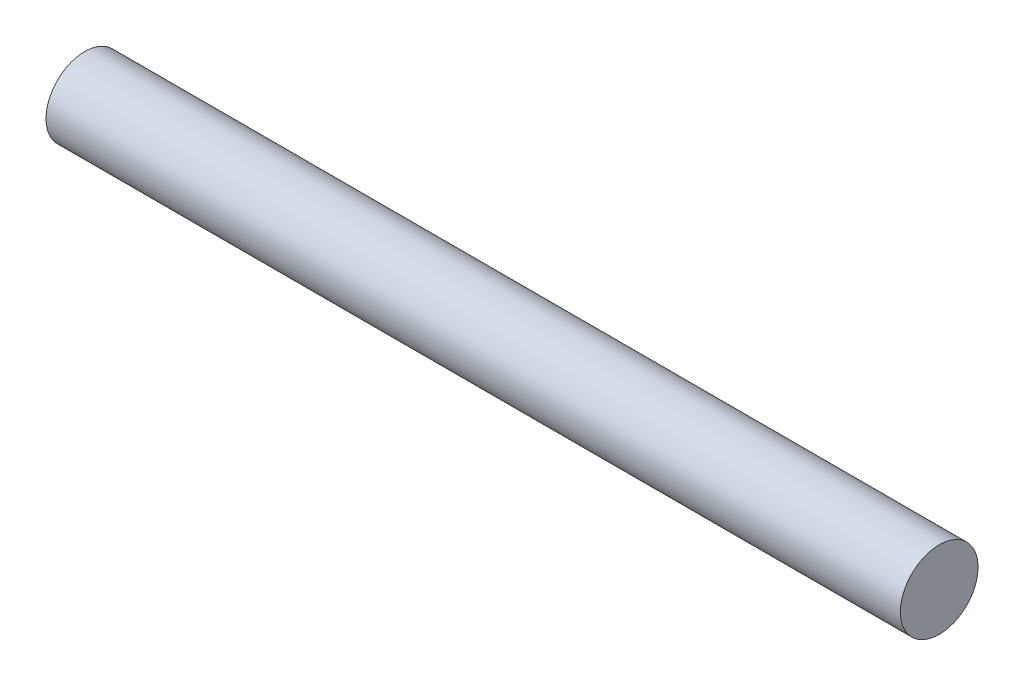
from build123d import *

# Parameters (mm, degrees)
ESQUISSE1_W = 110
ESQUISSE1_H = 5


with BuildPart() as part:
    # Esquisse1 → Base-R_volution (revolve)
    with BuildSketch(Plane.XY, mode=Mode.PRIVATE) as base_r_volution_sk:
        with Locations((38, 1.5)):
            Rectangle(ESQUISSE1_W, ESQUISSE1_H)
    revolve(base_r_volution_sk.sketch.rotate(Axis((-40, -1, 0), (1, 0, 0)), 90), axis=Axis((-40, -1, 0), (1, 0, 0)))


solid = part.part
